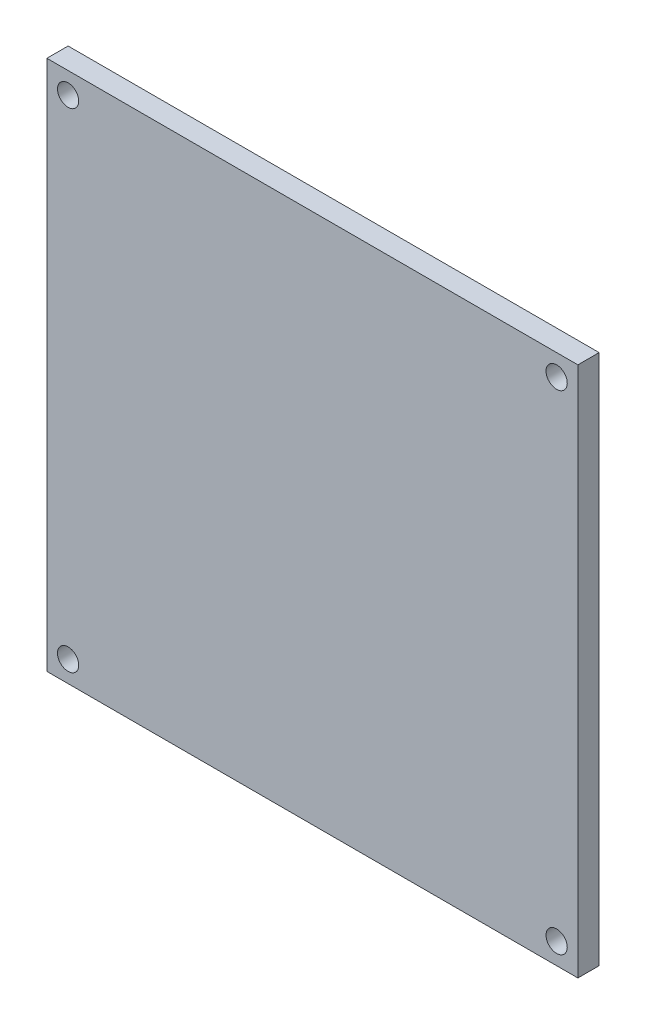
ISO-10303-21;
HEADER;
FILE_DESCRIPTION(('STEP AP214'),'2;1');
FILE_NAME('part.step','',(''),(''),'','','');
FILE_SCHEMA(('AUTOMOTIVE_DESIGN { 1 0 10303 214 1 1 1 1 }'));
ENDSEC;
DATA;
#1=APPLICATION_CONTEXT('core data for automotive mechanical design processes');
#2=APPLICATION_PROTOCOL_DEFINITION('international standard','automotive_design',2000,#1);
#3=PRODUCT_CONTEXT('',#1,'mechanical');
#4=PRODUCT('Part','Part','',(#3));
#5=PRODUCT_RELATED_PRODUCT_CATEGORY('part','',(#4));
#6=PRODUCT_DEFINITION_FORMATION('','',#4);
#7=PRODUCT_DEFINITION_CONTEXT('part definition',#1,'design');
#8=PRODUCT_DEFINITION('design','',#6,#7);
#9=PRODUCT_DEFINITION_SHAPE('','',#8);
#10=(LENGTH_UNIT() NAMED_UNIT(*) SI_UNIT(.MILLI.,.METRE.));
#11=(NAMED_UNIT(*) PLANE_ANGLE_UNIT() SI_UNIT($,.RADIAN.));
#12=(NAMED_UNIT(*) SI_UNIT($,.STERADIAN.) SOLID_ANGLE_UNIT());
#13=UNCERTAINTY_MEASURE_WITH_UNIT(LENGTH_MEASURE(1.E-05),#10,'distance_accuracy_value','');
#14=(GEOMETRIC_REPRESENTATION_CONTEXT(3) GLOBAL_UNCERTAINTY_ASSIGNED_CONTEXT((#13)) GLOBAL_UNIT_ASSIGNED_CONTEXT((#10,
#11,#12)) REPRESENTATION_CONTEXT('',''));
#15=CARTESIAN_POINT('',(0.,0.,0.));
#16=DIRECTION('',(0.,0.,1.));
#17=DIRECTION('',(1.,0.,0.));
#18=AXIS2_PLACEMENT_3D('',#15,#16,#17);
#19=CARTESIAN_POINT('',(0.,0.,10.));
#20=DIRECTION('',(1.,0.,0.));
#21=DIRECTION('',(0.,1.,0.));
#22=AXIS2_PLACEMENT_3D('',#19,#20,#21);
#23=PLANE('',#22);
#24=DIRECTION('',(0.,-1.,0.));
#25=VECTOR('',#24,1.);
#26=CARTESIAN_POINT('',(0.,0.,0.));
#27=LINE('',#26,#25);
#28=CARTESIAN_POINT('',(0.,0.,0.));
#29=VERTEX_POINT('',#28);
#30=CARTESIAN_POINT('',(0.,-250.,0.));
#31=VERTEX_POINT('',#30);
#32=EDGE_CURVE('E101',#29,#31,#27,.T.);
#33=ORIENTED_EDGE('',*,*,#32,.T.);
#34=DIRECTION('',(0.,0.,-1.));
#35=VECTOR('',#34,1.);
#36=CARTESIAN_POINT('',(0.,-250.,10.));
#37=LINE('',#36,#35);
#38=CARTESIAN_POINT('',(0.,-250.,10.));
#39=VERTEX_POINT('',#38);
#40=EDGE_CURVE('E11',#39,#31,#37,.T.);
#41=ORIENTED_EDGE('',*,*,#40,.F.);
#42=DIRECTION('',(0.,-1.,0.));
#43=VECTOR('',#42,1.);
#44=CARTESIAN_POINT('',(0.,0.,10.));
#45=LINE('',#44,#43);
#46=CARTESIAN_POINT('',(0.,0.,10.));
#47=VERTEX_POINT('',#46);
#48=EDGE_CURVE('E88',#47,#39,#45,.T.);
#49=ORIENTED_EDGE('',*,*,#48,.F.);
#50=DIRECTION('',(0.,0.,-1.));
#51=VECTOR('',#50,1.);
#52=CARTESIAN_POINT('',(0.,0.,10.));
#53=LINE('',#52,#51);
#54=EDGE_CURVE('E97',#47,#29,#53,.T.);
#55=ORIENTED_EDGE('',*,*,#54,.T.);
#56=EDGE_LOOP('',(#33,#41,#49,#55));
#57=FACE_BOUND('',#56,.T.);
#58=ADVANCED_FACE('F35',(#57),#23,.F.);
#59=CARTESIAN_POINT('',(0.,-250.,10.));
#60=DIRECTION('',(0.,1.,0.));
#61=DIRECTION('',(0.,0.,1.));
#62=AXIS2_PLACEMENT_3D('',#59,#60,#61);
#63=PLANE('',#62);
#64=DIRECTION('',(1.,0.,0.));
#65=VECTOR('',#64,1.);
#66=CARTESIAN_POINT('',(0.,-250.,0.));
#67=LINE('',#66,#65);
#68=CARTESIAN_POINT('',(250.,-250.,0.));
#69=VERTEX_POINT('',#68);
#70=EDGE_CURVE('E92',#31,#69,#67,.T.);
#71=ORIENTED_EDGE('',*,*,#70,.T.);
#72=DIRECTION('',(0.,0.,-1.));
#73=VECTOR('',#72,1.);
#74=CARTESIAN_POINT('',(250.,-250.,10.));
#75=LINE('',#74,#73);
#76=CARTESIAN_POINT('',(250.,-250.,10.));
#77=VERTEX_POINT('',#76);
#78=EDGE_CURVE('E44',#77,#69,#75,.T.);
#79=ORIENTED_EDGE('',*,*,#78,.F.);
#80=DIRECTION('',(1.,0.,0.));
#81=VECTOR('',#80,1.);
#82=CARTESIAN_POINT('',(0.,-250.,10.));
#83=LINE('',#82,#81);
#84=EDGE_CURVE('E83',#39,#77,#83,.T.);
#85=ORIENTED_EDGE('',*,*,#84,.F.);
#86=ORIENTED_EDGE('',*,*,#40,.T.);
#87=EDGE_LOOP('',(#71,#79,#85,#86));
#88=FACE_BOUND('',#87,.T.);
#89=ADVANCED_FACE('F91',(#88),#63,.F.);
#90=CARTESIAN_POINT('',(250.,0.,10.));
#91=DIRECTION('',(-1.,0.,0.));
#92=DIRECTION('',(0.,-1.,0.));
#93=AXIS2_PLACEMENT_3D('',#90,#91,#92);
#94=PLANE('',#93);
#95=DIRECTION('',(0.,1.,0.));
#96=VECTOR('',#95,1.);
#97=CARTESIAN_POINT('',(250.,0.,0.));
#98=LINE('',#97,#96);
#99=CARTESIAN_POINT('',(250.,0.,0.));
#100=VERTEX_POINT('',#99);
#101=EDGE_CURVE('E70',#69,#100,#98,.T.);
#102=ORIENTED_EDGE('',*,*,#101,.T.);
#103=DIRECTION('',(0.,0.,-1.));
#104=VECTOR('',#103,1.);
#105=CARTESIAN_POINT('',(250.,0.,10.));
#106=LINE('',#105,#104);
#107=CARTESIAN_POINT('',(250.,0.,10.));
#108=VERTEX_POINT('',#107);
#109=EDGE_CURVE('E93',#108,#100,#106,.T.);
#110=ORIENTED_EDGE('',*,*,#109,.F.);
#111=DIRECTION('',(0.,1.,0.));
#112=VECTOR('',#111,1.);
#113=CARTESIAN_POINT('',(250.,0.,10.));
#114=LINE('',#113,#112);
#115=EDGE_CURVE('E86',#77,#108,#114,.T.);
#116=ORIENTED_EDGE('',*,*,#115,.F.);
#117=ORIENTED_EDGE('',*,*,#78,.T.);
#118=EDGE_LOOP('',(#102,#110,#116,#117));
#119=FACE_BOUND('',#118,.T.);
#120=ADVANCED_FACE('F95',(#119),#94,.F.);
#121=CARTESIAN_POINT('',(0.,0.,10.));
#122=DIRECTION('',(0.,-1.,0.));
#123=DIRECTION('',(0.,0.,-1.));
#124=AXIS2_PLACEMENT_3D('',#121,#122,#123);
#125=PLANE('',#124);
#126=DIRECTION('',(-1.,0.,0.));
#127=VECTOR('',#126,1.);
#128=CARTESIAN_POINT('',(0.,0.,0.));
#129=LINE('',#128,#127);
#130=EDGE_CURVE('E76',#100,#29,#129,.T.);
#131=ORIENTED_EDGE('',*,*,#130,.T.);
#132=ORIENTED_EDGE('',*,*,#54,.F.);
#133=DIRECTION('',(-1.,0.,0.));
#134=VECTOR('',#133,1.);
#135=CARTESIAN_POINT('',(0.,0.,10.));
#136=LINE('',#135,#134);
#137=EDGE_CURVE('E53',#108,#47,#136,.T.);
#138=ORIENTED_EDGE('',*,*,#137,.F.);
#139=ORIENTED_EDGE('',*,*,#109,.T.);
#140=EDGE_LOOP('',(#131,#132,#138,#139));
#141=FACE_BOUND('',#140,.T.);
#142=ADVANCED_FACE('F158',(#141),#125,.F.);
#143=CARTESIAN_POINT('',(0.,-250.,10.));
#144=DIRECTION('',(0.,0.,1.));
#145=DIRECTION('',(1.,0.,0.));
#146=AXIS2_PLACEMENT_3D('',#143,#144,#145);
#147=PLANE('',#146);
#148=CARTESIAN_POINT('',(10.,-9.99999999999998,10.));
#149=DIRECTION('',(0.,0.,1.));
#150=DIRECTION('',(1.,0.,0.));
#151=AXIS2_PLACEMENT_3D('',#148,#149,#150);
#152=CIRCLE('',#151,5.);
#153=CARTESIAN_POINT('',(15.,-9.99999999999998,10.));
#154=VERTEX_POINT('',#153);
#155=EDGE_CURVE('E126',#154,#154,#152,.T.);
#156=ORIENTED_EDGE('',*,*,#155,.F.);
#157=EDGE_LOOP('',(#156));
#158=FACE_BOUND('',#157,.T.);
#159=CARTESIAN_POINT('',(240.,-10.,10.));
#160=DIRECTION('',(0.,0.,1.));
#161=DIRECTION('',(1.,0.,0.));
#162=AXIS2_PLACEMENT_3D('',#159,#160,#161);
#163=CIRCLE('',#162,5.);
#164=CARTESIAN_POINT('',(245.,-10.,10.));
#165=VERTEX_POINT('',#164);
#166=EDGE_CURVE('E116',#165,#165,#163,.T.);
#167=ORIENTED_EDGE('',*,*,#166,.F.);
#168=EDGE_LOOP('',(#167));
#169=FACE_BOUND('',#168,.T.);
#170=CARTESIAN_POINT('',(10.,-240.,10.));
#171=DIRECTION('',(0.,0.,1.));
#172=DIRECTION('',(1.,0.,0.));
#173=AXIS2_PLACEMENT_3D('',#170,#171,#172);
#174=CIRCLE('',#173,5.);
#175=CARTESIAN_POINT('',(15.,-240.,10.));
#176=VERTEX_POINT('',#175);
#177=EDGE_CURVE('E113',#176,#176,#174,.T.);
#178=ORIENTED_EDGE('',*,*,#177,.F.);
#179=EDGE_LOOP('',(#178));
#180=FACE_BOUND('',#179,.T.);
#181=CARTESIAN_POINT('',(240.,-240.,10.));
#182=DIRECTION('',(0.,0.,1.));
#183=DIRECTION('',(1.,0.,0.));
#184=AXIS2_PLACEMENT_3D('',#181,#182,#183);
#185=CIRCLE('',#184,5.);
#186=CARTESIAN_POINT('',(245.,-240.,10.));
#187=VERTEX_POINT('',#186);
#188=EDGE_CURVE('E112',#187,#187,#185,.T.);
#189=ORIENTED_EDGE('',*,*,#188,.F.);
#190=EDGE_LOOP('',(#189));
#191=FACE_BOUND('',#190,.T.);
#192=ORIENTED_EDGE('',*,*,#48,.T.);
#193=ORIENTED_EDGE('',*,*,#84,.T.);
#194=ORIENTED_EDGE('',*,*,#115,.T.);
#195=ORIENTED_EDGE('',*,*,#137,.T.);
#196=EDGE_LOOP('',(#192,#193,#194,#195));
#197=FACE_BOUND('',#196,.T.);
#198=ADVANCED_FACE('F84',(#158,#169,#180,#191,#197),#147,.T.);
#199=CARTESIAN_POINT('',(0.,-250.,0.));
#200=DIRECTION('',(0.,0.,1.));
#201=DIRECTION('',(1.,0.,0.));
#202=AXIS2_PLACEMENT_3D('',#199,#200,#201);
#203=PLANE('',#202);
#204=CARTESIAN_POINT('',(10.,-9.99999999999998,0.));
#205=DIRECTION('',(0.,0.,1.));
#206=DIRECTION('',(1.,0.,0.));
#207=AXIS2_PLACEMENT_3D('',#204,#205,#206);
#208=CIRCLE('',#207,5.);
#209=CARTESIAN_POINT('',(15.,-9.99999999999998,0.));
#210=VERTEX_POINT('',#209);
#211=EDGE_CURVE('E38',#210,#210,#208,.T.);
#212=ORIENTED_EDGE('',*,*,#211,.T.);
#213=EDGE_LOOP('',(#212));
#214=FACE_BOUND('',#213,.T.);
#215=CARTESIAN_POINT('',(240.,-10.,0.));
#216=DIRECTION('',(0.,0.,1.));
#217=DIRECTION('',(1.,0.,0.));
#218=AXIS2_PLACEMENT_3D('',#215,#216,#217);
#219=CIRCLE('',#218,5.);
#220=CARTESIAN_POINT('',(245.,-10.,0.));
#221=VERTEX_POINT('',#220);
#222=EDGE_CURVE('E114',#221,#221,#219,.T.);
#223=ORIENTED_EDGE('',*,*,#222,.T.);
#224=EDGE_LOOP('',(#223));
#225=FACE_BOUND('',#224,.T.);
#226=CARTESIAN_POINT('',(10.,-240.,0.));
#227=DIRECTION('',(0.,0.,1.));
#228=DIRECTION('',(1.,0.,0.));
#229=AXIS2_PLACEMENT_3D('',#226,#227,#228);
#230=CIRCLE('',#229,5.);
#231=CARTESIAN_POINT('',(15.,-240.,0.));
#232=VERTEX_POINT('',#231);
#233=EDGE_CURVE('E110',#232,#232,#230,.T.);
#234=ORIENTED_EDGE('',*,*,#233,.T.);
#235=EDGE_LOOP('',(#234));
#236=FACE_BOUND('',#235,.T.);
#237=CARTESIAN_POINT('',(240.,-240.,0.));
#238=DIRECTION('',(0.,0.,1.));
#239=DIRECTION('',(1.,0.,0.));
#240=AXIS2_PLACEMENT_3D('',#237,#238,#239);
#241=CIRCLE('',#240,5.);
#242=CARTESIAN_POINT('',(245.,-240.,0.));
#243=VERTEX_POINT('',#242);
#244=EDGE_CURVE('E104',#243,#243,#241,.T.);
#245=ORIENTED_EDGE('',*,*,#244,.T.);
#246=EDGE_LOOP('',(#245));
#247=FACE_BOUND('',#246,.T.);
#248=ORIENTED_EDGE('',*,*,#32,.F.);
#249=ORIENTED_EDGE('',*,*,#130,.F.);
#250=ORIENTED_EDGE('',*,*,#101,.F.);
#251=ORIENTED_EDGE('',*,*,#70,.F.);
#252=EDGE_LOOP('',(#248,#249,#250,#251));
#253=FACE_BOUND('',#252,.T.);
#254=ADVANCED_FACE('F134',(#214,#225,#236,#247,#253),#203,.F.);
#255=CARTESIAN_POINT('',(240.,-240.,10.));
#256=DIRECTION('',(0.,0.,1.));
#257=DIRECTION('',(1.,0.,0.));
#258=AXIS2_PLACEMENT_3D('',#255,#256,#257);
#259=CYLINDRICAL_SURFACE('',#258,5.);
#260=ORIENTED_EDGE('',*,*,#188,.T.);
#261=EDGE_LOOP('',(#260));
#262=FACE_BOUND('',#261,.T.);
#263=ORIENTED_EDGE('',*,*,#244,.F.);
#264=EDGE_LOOP('',(#263));
#265=FACE_BOUND('',#264,.T.);
#266=ADVANCED_FACE('F137',(#262,#265),#259,.F.);
#267=CARTESIAN_POINT('',(10.,-240.,10.));
#268=DIRECTION('',(0.,0.,1.));
#269=DIRECTION('',(1.,0.,0.));
#270=AXIS2_PLACEMENT_3D('',#267,#268,#269);
#271=CYLINDRICAL_SURFACE('',#270,5.);
#272=ORIENTED_EDGE('',*,*,#177,.T.);
#273=EDGE_LOOP('',(#272));
#274=FACE_BOUND('',#273,.T.);
#275=ORIENTED_EDGE('',*,*,#233,.F.);
#276=EDGE_LOOP('',(#275));
#277=FACE_BOUND('',#276,.T.);
#278=ADVANCED_FACE('F139',(#274,#277),#271,.F.);
#279=CARTESIAN_POINT('',(240.,-10.,10.));
#280=DIRECTION('',(0.,0.,1.));
#281=DIRECTION('',(1.,0.,0.));
#282=AXIS2_PLACEMENT_3D('',#279,#280,#281);
#283=CYLINDRICAL_SURFACE('',#282,5.);
#284=ORIENTED_EDGE('',*,*,#166,.T.);
#285=EDGE_LOOP('',(#284));
#286=FACE_BOUND('',#285,.T.);
#287=ORIENTED_EDGE('',*,*,#222,.F.);
#288=EDGE_LOOP('',(#287));
#289=FACE_BOUND('',#288,.T.);
#290=ADVANCED_FACE('F146',(#286,#289),#283,.F.);
#291=CARTESIAN_POINT('',(10.,-9.99999999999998,10.));
#292=DIRECTION('',(0.,0.,1.));
#293=DIRECTION('',(1.,0.,0.));
#294=AXIS2_PLACEMENT_3D('',#291,#292,#293);
#295=CYLINDRICAL_SURFACE('',#294,5.);
#296=ORIENTED_EDGE('',*,*,#155,.T.);
#297=EDGE_LOOP('',(#296));
#298=FACE_BOUND('',#297,.T.);
#299=ORIENTED_EDGE('',*,*,#211,.F.);
#300=EDGE_LOOP('',(#299));
#301=FACE_BOUND('',#300,.T.);
#302=ADVANCED_FACE('F212',(#298,#301),#295,.F.);
#303=CLOSED_SHELL('',(#58,#89,#120,#142,#198,#254,#266,#278,#290,#302));
#304=MANIFOLD_SOLID_BREP('B2',#303);
#305=ADVANCED_BREP_SHAPE_REPRESENTATION('',(#18,#304),#14);
#306=SHAPE_DEFINITION_REPRESENTATION(#9,#305);
ENDSEC;
END-ISO-10303-21;
